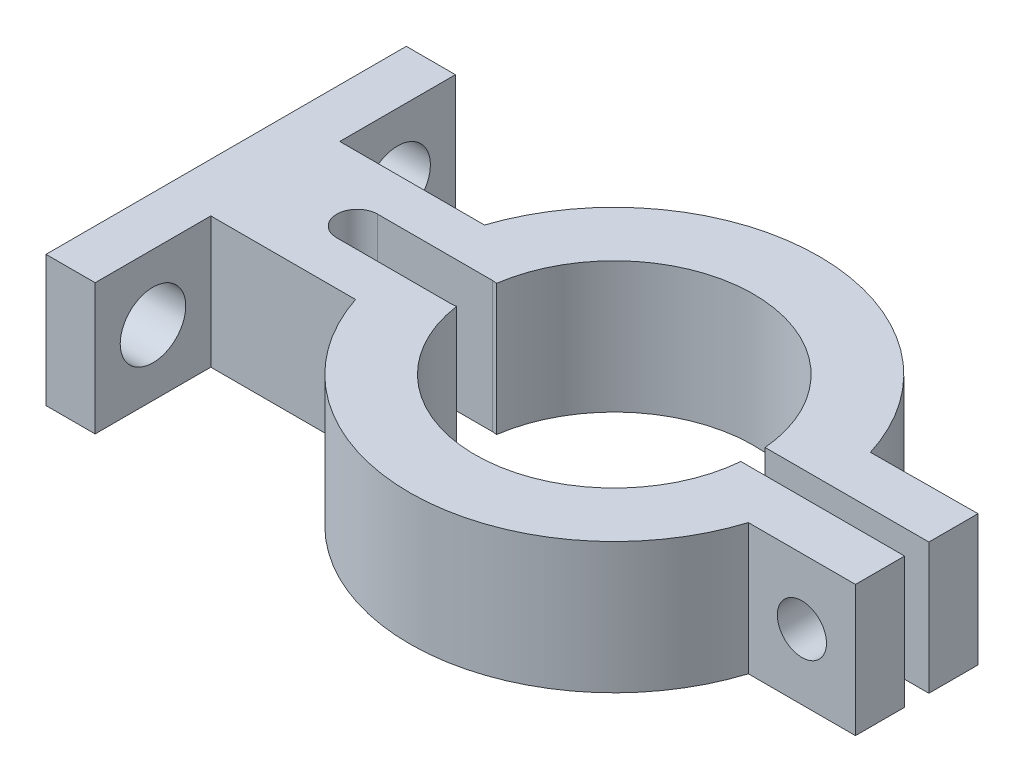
ISO-10303-21;
HEADER;
FILE_DESCRIPTION(('STEP AP214'),'2;1');
FILE_NAME('part.step','',(''),(''),'','','');
FILE_SCHEMA(('AUTOMOTIVE_DESIGN { 1 0 10303 214 1 1 1 1 }'));
ENDSEC;
DATA;
#1=APPLICATION_CONTEXT('core data for automotive mechanical design processes');
#2=APPLICATION_PROTOCOL_DEFINITION('international standard','automotive_design',2000,#1);
#3=PRODUCT_CONTEXT('',#1,'mechanical');
#4=PRODUCT('Part','Part','',(#3));
#5=PRODUCT_RELATED_PRODUCT_CATEGORY('part','',(#4));
#6=PRODUCT_DEFINITION_FORMATION('','',#4);
#7=PRODUCT_DEFINITION_CONTEXT('part definition',#1,'design');
#8=PRODUCT_DEFINITION('design','',#6,#7);
#9=PRODUCT_DEFINITION_SHAPE('','',#8);
#10=(LENGTH_UNIT() NAMED_UNIT(*) SI_UNIT(.MILLI.,.METRE.));
#11=(NAMED_UNIT(*) PLANE_ANGLE_UNIT() SI_UNIT($,.RADIAN.));
#12=(NAMED_UNIT(*) SI_UNIT($,.STERADIAN.) SOLID_ANGLE_UNIT());
#13=UNCERTAINTY_MEASURE_WITH_UNIT(LENGTH_MEASURE(1.E-05),#10,'distance_accuracy_value','');
#14=(GEOMETRIC_REPRESENTATION_CONTEXT(3) GLOBAL_UNCERTAINTY_ASSIGNED_CONTEXT((#13)) GLOBAL_UNIT_ASSIGNED_CONTEXT((#10,
#11,#12)) REPRESENTATION_CONTEXT('',''));
#15=CARTESIAN_POINT('',(0.,0.,0.));
#16=DIRECTION('',(0.,0.,1.));
#17=DIRECTION('',(1.,0.,0.));
#18=AXIS2_PLACEMENT_3D('',#15,#16,#17);
#19=CARTESIAN_POINT('',(16.2,8.,0.));
#20=DIRECTION('',(0.,-1.,0.));
#21=DIRECTION('',(0.,0.,-1.));
#22=AXIS2_PLACEMENT_3D('',#19,#20,#21);
#23=CYLINDRICAL_SURFACE('',#22,8.5);
#24=DIRECTION('',(0.,1.,0.));
#25=VECTOR('',#24,1.);
#26=CARTESIAN_POINT('',(7.7875,4.,-1.21648828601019));
#27=LINE('',#26,#25);
#28=CARTESIAN_POINT('',(7.7875,0.,-1.21648828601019));
#29=VERTEX_POINT('',#28);
#30=CARTESIAN_POINT('',(7.7875,8.,-1.21648828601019));
#31=VERTEX_POINT('',#30);
#32=EDGE_CURVE('E282',#29,#31,#27,.T.);
#33=ORIENTED_EDGE('',*,*,#32,.F.);
#34=CARTESIAN_POINT('',(16.2,0.,0.));
#35=DIRECTION('',(0.,1.,0.));
#36=DIRECTION('',(0.,0.,1.));
#37=AXIS2_PLACEMENT_3D('',#34,#35,#36);
#38=CIRCLE('',#37,8.5);
#39=CARTESIAN_POINT('',(24.6676549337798,0.,-0.740823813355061));
#40=VERTEX_POINT('',#39);
#41=EDGE_CURVE('E216',#40,#29,#38,.T.);
#42=ORIENTED_EDGE('',*,*,#41,.F.);
#43=DIRECTION('',(0.,-1.,0.));
#44=VECTOR('',#43,1.);
#45=CARTESIAN_POINT('',(24.6676549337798,8.,-0.740823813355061));
#46=LINE('',#45,#44);
#47=CARTESIAN_POINT('',(24.6676549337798,8.,-0.740823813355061));
#48=VERTEX_POINT('',#47);
#49=EDGE_CURVE('E260',#48,#40,#46,.T.);
#50=ORIENTED_EDGE('',*,*,#49,.F.);
#51=CARTESIAN_POINT('',(16.2,8.,0.));
#52=DIRECTION('',(0.,1.,0.));
#53=DIRECTION('',(0.,0.,1.));
#54=AXIS2_PLACEMENT_3D('',#51,#52,#53);
#55=CIRCLE('',#54,8.5);
#56=EDGE_CURVE('E315',#48,#31,#55,.T.);
#57=ORIENTED_EDGE('',*,*,#56,.T.);
#58=EDGE_LOOP('',(#33,#42,#50,#57));
#59=FACE_BOUND('',#58,.T.);
#60=ADVANCED_FACE('F39',(#59),#23,.F.);
#61=CARTESIAN_POINT('',(-7.5,8.,0.));
#62=DIRECTION('',(-1.,0.,0.));
#63=DIRECTION('',(0.,0.,1.));
#64=AXIS2_PLACEMENT_3D('',#61,#62,#63);
#65=PLANE('',#64);
#66=DIRECTION('',(0.,0.,-1.));
#67=VECTOR('',#66,1.);
#68=CARTESIAN_POINT('',(-7.5,0.,0.));
#69=LINE('',#68,#67);
#70=CARTESIAN_POINT('',(-7.5,0.,11.));
#71=VERTEX_POINT('',#70);
#72=CARTESIAN_POINT('',(-7.5,0.,-11.));
#73=VERTEX_POINT('',#72);
#74=EDGE_CURVE('E177',#71,#73,#69,.T.);
#75=ORIENTED_EDGE('',*,*,#74,.F.);
#76=DIRECTION('',(0.,-1.,0.));
#77=VECTOR('',#76,1.);
#78=CARTESIAN_POINT('',(-7.5,8.,11.));
#79=LINE('',#78,#77);
#80=CARTESIAN_POINT('',(-7.5,8.,11.));
#81=VERTEX_POINT('',#80);
#82=EDGE_CURVE('E170',#81,#71,#79,.T.);
#83=ORIENTED_EDGE('',*,*,#82,.F.);
#84=DIRECTION('',(0.,0.,-1.));
#85=VECTOR('',#84,1.);
#86=CARTESIAN_POINT('',(-7.5,8.,0.));
#87=LINE('',#86,#85);
#88=CARTESIAN_POINT('',(-7.5,8.,-11.));
#89=VERTEX_POINT('',#88);
#90=EDGE_CURVE('E175',#81,#89,#87,.T.);
#91=ORIENTED_EDGE('',*,*,#90,.T.);
#92=DIRECTION('',(0.,-1.,0.));
#93=VECTOR('',#92,1.);
#94=CARTESIAN_POINT('',(-7.5,8.,-11.));
#95=LINE('',#94,#93);
#96=EDGE_CURVE('E180',#89,#73,#95,.T.);
#97=ORIENTED_EDGE('',*,*,#96,.T.);
#98=EDGE_LOOP('',(#75,#83,#91,#97));
#99=FACE_BOUND('',#98,.T.);
#100=CARTESIAN_POINT('',(-7.5,4.,-7.46850393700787));
#101=DIRECTION('',(-1.,0.,0.));
#102=DIRECTION('',(0.,0.,1.));
#103=AXIS2_PLACEMENT_3D('',#100,#101,#102);
#104=CIRCLE('',#103,2.);
#105=CARTESIAN_POINT('',(-7.5,4.,-5.46850393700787));
#106=VERTEX_POINT('',#105);
#107=EDGE_CURVE('E293',#106,#106,#104,.T.);
#108=ORIENTED_EDGE('',*,*,#107,.F.);
#109=EDGE_LOOP('',(#108));
#110=FACE_BOUND('',#109,.T.);
#111=CARTESIAN_POINT('',(-7.5,4.,7.46850393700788));
#112=DIRECTION('',(-1.,0.,0.));
#113=DIRECTION('',(0.,0.,1.));
#114=AXIS2_PLACEMENT_3D('',#111,#112,#113);
#115=CIRCLE('',#114,2.);
#116=CARTESIAN_POINT('',(-7.5,4.,9.46850393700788));
#117=VERTEX_POINT('',#116);
#118=EDGE_CURVE('E296',#117,#117,#115,.F.);
#119=ORIENTED_EDGE('',*,*,#118,.T.);
#120=EDGE_LOOP('',(#119));
#121=FACE_BOUND('',#120,.T.);
#122=ADVANCED_FACE('F172',(#99,#110,#121),#65,.T.);
#123=CARTESIAN_POINT('',(0.,8.,3.93700787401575));
#124=DIRECTION('',(0.,0.,-1.));
#125=DIRECTION('',(-1.,0.,0.));
#126=AXIS2_PLACEMENT_3D('',#123,#124,#125);
#127=PLANE('',#126);
#128=DIRECTION('',(1.,0.,0.));
#129=VECTOR('',#128,1.);
#130=CARTESIAN_POINT('',(0.,0.,3.93700787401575));
#131=LINE('',#130,#129);
#132=CARTESIAN_POINT('',(-4.5,0.,3.93700787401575));
#133=VERTEX_POINT('',#132);
#134=CARTESIAN_POINT('',(4.33619078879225,0.,3.93700787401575));
#135=VERTEX_POINT('',#134);
#136=EDGE_CURVE('E200',#133,#135,#131,.T.);
#137=ORIENTED_EDGE('',*,*,#136,.T.);
#138=DIRECTION('',(0.,-1.,0.));
#139=VECTOR('',#138,1.);
#140=CARTESIAN_POINT('',(4.33619078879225,8.,3.93700787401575));
#141=LINE('',#140,#139);
#142=CARTESIAN_POINT('',(4.33619078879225,8.,3.93700787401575));
#143=VERTEX_POINT('',#142);
#144=EDGE_CURVE('E47',#143,#135,#141,.T.);
#145=ORIENTED_EDGE('',*,*,#144,.F.);
#146=DIRECTION('',(1.,0.,0.));
#147=VECTOR('',#146,1.);
#148=CARTESIAN_POINT('',(0.,8.,3.93700787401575));
#149=LINE('',#148,#147);
#150=CARTESIAN_POINT('',(-4.5,8.,3.93700787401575));
#151=VERTEX_POINT('',#150);
#152=EDGE_CURVE('E243',#151,#143,#149,.T.);
#153=ORIENTED_EDGE('',*,*,#152,.F.);
#154=DIRECTION('',(0.,-1.,0.));
#155=VECTOR('',#154,1.);
#156=CARTESIAN_POINT('',(-4.5,8.,3.93700787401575));
#157=LINE('',#156,#155);
#158=EDGE_CURVE('E199',#151,#133,#157,.T.);
#159=ORIENTED_EDGE('',*,*,#158,.T.);
#160=EDGE_LOOP('',(#137,#145,#153,#159));
#161=FACE_BOUND('',#160,.T.);
#162=ADVANCED_FACE('F41',(#161),#127,.F.);
#163=CARTESIAN_POINT('',(16.2,8.,0.));
#164=DIRECTION('',(0.,-1.,0.));
#165=DIRECTION('',(0.,0.,-1.));
#166=AXIS2_PLACEMENT_3D('',#163,#164,#165);
#167=CYLINDRICAL_SURFACE('',#166,12.5);
#168=CARTESIAN_POINT('',(16.2,0.,0.));
#169=DIRECTION('',(0.,1.,0.));
#170=DIRECTION('',(0.,0.,1.));
#171=AXIS2_PLACEMENT_3D('',#168,#169,#170);
#172=CIRCLE('',#171,12.5);
#173=CARTESIAN_POINT('',(28.1271219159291,0.,3.74082381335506));
#174=VERTEX_POINT('',#173);
#175=EDGE_CURVE('E203',#135,#174,#172,.T.);
#176=ORIENTED_EDGE('',*,*,#175,.T.);
#177=DIRECTION('',(0.,-1.,0.));
#178=VECTOR('',#177,1.);
#179=CARTESIAN_POINT('',(28.1271219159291,8.,3.74082381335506));
#180=LINE('',#179,#178);
#181=CARTESIAN_POINT('',(28.1271219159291,8.,3.74082381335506));
#182=VERTEX_POINT('',#181);
#183=EDGE_CURVE('E269',#182,#174,#180,.T.);
#184=ORIENTED_EDGE('',*,*,#183,.F.);
#185=CARTESIAN_POINT('',(16.2,8.,0.));
#186=DIRECTION('',(0.,1.,0.));
#187=DIRECTION('',(0.,0.,1.));
#188=AXIS2_PLACEMENT_3D('',#185,#186,#187);
#189=CIRCLE('',#188,12.5);
#190=EDGE_CURVE('E129',#143,#182,#189,.T.);
#191=ORIENTED_EDGE('',*,*,#190,.F.);
#192=ORIENTED_EDGE('',*,*,#144,.T.);
#193=EDGE_LOOP('',(#176,#184,#191,#192));
#194=FACE_BOUND('',#193,.T.);
#195=ADVANCED_FACE('F348',(#194),#167,.T.);
#196=CARTESIAN_POINT('',(0.,8.,3.74082381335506));
#197=DIRECTION('',(0.,0.,-1.));
#198=DIRECTION('',(-1.,0.,0.));
#199=AXIS2_PLACEMENT_3D('',#196,#197,#198);
#200=PLANE('',#199);
#201=CARTESIAN_POINT('',(31.3973884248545,4.,3.74082381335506));
#202=DIRECTION('',(0.,0.,1.));
#203=DIRECTION('',(1.,0.,0.));
#204=AXIS2_PLACEMENT_3D('',#201,#202,#203);
#205=CIRCLE('',#204,1.5);
#206=CARTESIAN_POINT('',(32.8973884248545,4.,3.74082381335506));
#207=VERTEX_POINT('',#206);
#208=EDGE_CURVE('E275',#207,#207,#205,.T.);
#209=ORIENTED_EDGE('',*,*,#208,.F.);
#210=EDGE_LOOP('',(#209));
#211=FACE_BOUND('',#210,.T.);
#212=DIRECTION('',(1.,0.,0.));
#213=VECTOR('',#212,1.);
#214=CARTESIAN_POINT('',(0.,0.,3.74082381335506));
#215=LINE('',#214,#213);
#216=CARTESIAN_POINT('',(34.6676549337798,0.,3.74082381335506));
#217=VERTEX_POINT('',#216);
#218=EDGE_CURVE('E206',#174,#217,#215,.T.);
#219=ORIENTED_EDGE('',*,*,#218,.T.);
#220=DIRECTION('',(0.,-1.,0.));
#221=VECTOR('',#220,1.);
#222=CARTESIAN_POINT('',(34.6676549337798,8.,3.74082381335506));
#223=LINE('',#222,#221);
#224=CARTESIAN_POINT('',(34.6676549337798,8.,3.74082381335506));
#225=VERTEX_POINT('',#224);
#226=EDGE_CURVE('E267',#225,#217,#223,.T.);
#227=ORIENTED_EDGE('',*,*,#226,.F.);
#228=DIRECTION('',(1.,0.,0.));
#229=VECTOR('',#228,1.);
#230=CARTESIAN_POINT('',(0.,8.,3.74082381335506));
#231=LINE('',#230,#229);
#232=EDGE_CURVE('E306',#182,#225,#231,.T.);
#233=ORIENTED_EDGE('',*,*,#232,.F.);
#234=ORIENTED_EDGE('',*,*,#183,.T.);
#235=EDGE_LOOP('',(#219,#227,#233,#234));
#236=FACE_BOUND('',#235,.T.);
#237=ADVANCED_FACE('F351',(#211,#236),#200,.F.);
#238=CARTESIAN_POINT('',(34.6676549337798,8.,0.));
#239=DIRECTION('',(1.,0.,0.));
#240=DIRECTION('',(0.,0.,-1.));
#241=AXIS2_PLACEMENT_3D('',#238,#239,#240);
#242=PLANE('',#241);
#243=DIRECTION('',(0.,0.,1.));
#244=VECTOR('',#243,1.);
#245=CARTESIAN_POINT('',(34.6676549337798,0.,0.));
#246=LINE('',#245,#244);
#247=CARTESIAN_POINT('',(34.6676549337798,0.,0.740823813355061));
#248=VERTEX_POINT('',#247);
#249=EDGE_CURVE('E209',#248,#217,#246,.T.);
#250=ORIENTED_EDGE('',*,*,#249,.F.);
#251=DIRECTION('',(0.,-1.,0.));
#252=VECTOR('',#251,1.);
#253=CARTESIAN_POINT('',(34.6676549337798,8.,0.740823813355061));
#254=LINE('',#253,#252);
#255=CARTESIAN_POINT('',(34.6676549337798,8.,0.740823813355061));
#256=VERTEX_POINT('',#255);
#257=EDGE_CURVE('E265',#256,#248,#254,.T.);
#258=ORIENTED_EDGE('',*,*,#257,.F.);
#259=DIRECTION('',(0.,0.,1.));
#260=VECTOR('',#259,1.);
#261=CARTESIAN_POINT('',(34.6676549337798,8.,0.));
#262=LINE('',#261,#260);
#263=EDGE_CURVE('E308',#256,#225,#262,.T.);
#264=ORIENTED_EDGE('',*,*,#263,.T.);
#265=ORIENTED_EDGE('',*,*,#226,.T.);
#266=EDGE_LOOP('',(#250,#258,#264,#265));
#267=FACE_BOUND('',#266,.T.);
#268=ADVANCED_FACE('F354',(#267),#242,.T.);
#269=CARTESIAN_POINT('',(0.,8.,0.740823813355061));
#270=DIRECTION('',(0.,0.,-1.));
#271=DIRECTION('',(-1.,0.,0.));
#272=AXIS2_PLACEMENT_3D('',#269,#270,#271);
#273=PLANE('',#272);
#274=CARTESIAN_POINT('',(31.3973884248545,4.,0.740823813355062));
#275=DIRECTION('',(0.,0.,-1.));
#276=DIRECTION('',(-1.,0.,0.));
#277=AXIS2_PLACEMENT_3D('',#274,#275,#276);
#278=CIRCLE('',#277,1.5);
#279=CARTESIAN_POINT('',(29.8973884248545,4.,0.740823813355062));
#280=VERTEX_POINT('',#279);
#281=EDGE_CURVE('E279',#280,#280,#278,.T.);
#282=ORIENTED_EDGE('',*,*,#281,.F.);
#283=EDGE_LOOP('',(#282));
#284=FACE_BOUND('',#283,.T.);
#285=DIRECTION('',(1.,0.,0.));
#286=VECTOR('',#285,1.);
#287=CARTESIAN_POINT('',(0.,0.,0.740823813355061));
#288=LINE('',#287,#286);
#289=CARTESIAN_POINT('',(24.6676549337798,0.,0.740823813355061));
#290=VERTEX_POINT('',#289);
#291=EDGE_CURVE('E212',#290,#248,#288,.T.);
#292=ORIENTED_EDGE('',*,*,#291,.F.);
#293=DIRECTION('',(0.,-1.,0.));
#294=VECTOR('',#293,1.);
#295=CARTESIAN_POINT('',(24.6676549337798,8.,0.740823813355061));
#296=LINE('',#295,#294);
#297=CARTESIAN_POINT('',(24.6676549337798,8.,0.740823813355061));
#298=VERTEX_POINT('',#297);
#299=EDGE_CURVE('E262',#298,#290,#296,.T.);
#300=ORIENTED_EDGE('',*,*,#299,.F.);
#301=DIRECTION('',(1.,0.,0.));
#302=VECTOR('',#301,1.);
#303=CARTESIAN_POINT('',(0.,8.,0.740823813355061));
#304=LINE('',#303,#302);
#305=EDGE_CURVE('E311',#298,#256,#304,.T.);
#306=ORIENTED_EDGE('',*,*,#305,.T.);
#307=ORIENTED_EDGE('',*,*,#257,.T.);
#308=EDGE_LOOP('',(#292,#300,#306,#307));
#309=FACE_BOUND('',#308,.T.);
#310=ADVANCED_FACE('F360',(#284,#309),#273,.T.);
#311=DIRECTION('',(0.,1.,0.));
#312=VECTOR('',#311,1.);
#313=CARTESIAN_POINT('',(7.7875,4.,1.21648828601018));
#314=LINE('',#313,#312);
#315=CARTESIAN_POINT('',(7.7875,8.,1.21648828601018));
#316=VERTEX_POINT('',#315);
#317=CARTESIAN_POINT('',(7.7875,0.,1.21648828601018));
#318=VERTEX_POINT('',#317);
#319=EDGE_CURVE('E287',#316,#318,#314,.F.);
#320=ORIENTED_EDGE('',*,*,#319,.F.);
#321=EDGE_CURVE('E314',#316,#298,#55,.T.);
#322=ORIENTED_EDGE('',*,*,#321,.T.);
#323=ORIENTED_EDGE('',*,*,#299,.T.);
#324=EDGE_CURVE('E215',#318,#290,#38,.T.);
#325=ORIENTED_EDGE('',*,*,#324,.F.);
#326=EDGE_LOOP('',(#320,#322,#323,#325));
#327=FACE_BOUND('',#326,.T.);
#328=ADVANCED_FACE('F364',(#327),#23,.F.);
#329=CARTESIAN_POINT('',(0.,8.,-0.740823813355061));
#330=DIRECTION('',(0.,0.,-1.));
#331=DIRECTION('',(-1.,0.,0.));
#332=AXIS2_PLACEMENT_3D('',#329,#330,#331);
#333=PLANE('',#332);
#334=CARTESIAN_POINT('',(31.3973884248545,4.,-0.740823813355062));
#335=DIRECTION('',(0.,0.,-1.));
#336=DIRECTION('',(-1.,0.,0.));
#337=AXIS2_PLACEMENT_3D('',#334,#335,#336);
#338=CIRCLE('',#337,1.5);
#339=CARTESIAN_POINT('',(29.8973884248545,4.,-0.740823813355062));
#340=VERTEX_POINT('',#339);
#341=EDGE_CURVE('E274',#340,#340,#338,.T.);
#342=ORIENTED_EDGE('',*,*,#341,.T.);
#343=EDGE_LOOP('',(#342));
#344=FACE_BOUND('',#343,.T.);
#345=DIRECTION('',(1.,0.,0.));
#346=VECTOR('',#345,1.);
#347=CARTESIAN_POINT('',(0.,0.,-0.740823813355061));
#348=LINE('',#347,#346);
#349=CARTESIAN_POINT('',(34.6676549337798,0.,-0.740823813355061));
#350=VERTEX_POINT('',#349);
#351=EDGE_CURVE('E219',#40,#350,#348,.T.);
#352=ORIENTED_EDGE('',*,*,#351,.T.);
#353=DIRECTION('',(0.,-1.,0.));
#354=VECTOR('',#353,1.);
#355=CARTESIAN_POINT('',(34.6676549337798,8.,-0.740823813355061));
#356=LINE('',#355,#354);
#357=CARTESIAN_POINT('',(34.6676549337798,8.,-0.740823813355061));
#358=VERTEX_POINT('',#357);
#359=EDGE_CURVE('E257',#358,#350,#356,.T.);
#360=ORIENTED_EDGE('',*,*,#359,.F.);
#361=DIRECTION('',(1.,0.,0.));
#362=VECTOR('',#361,1.);
#363=CARTESIAN_POINT('',(0.,8.,-0.740823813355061));
#364=LINE('',#363,#362);
#365=EDGE_CURVE('E318',#48,#358,#364,.T.);
#366=ORIENTED_EDGE('',*,*,#365,.F.);
#367=ORIENTED_EDGE('',*,*,#49,.T.);
#368=EDGE_LOOP('',(#352,#360,#366,#367));
#369=FACE_BOUND('',#368,.T.);
#370=ADVANCED_FACE('F399',(#344,#369),#333,.F.);
#371=CARTESIAN_POINT('',(34.6676549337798,8.,0.));
#372=DIRECTION('',(-1.,0.,0.));
#373=DIRECTION('',(0.,0.,1.));
#374=AXIS2_PLACEMENT_3D('',#371,#372,#373);
#375=PLANE('',#374);
#376=DIRECTION('',(0.,0.,-1.));
#377=VECTOR('',#376,1.);
#378=CARTESIAN_POINT('',(34.6676549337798,0.,0.));
#379=LINE('',#378,#377);
#380=CARTESIAN_POINT('',(34.6676549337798,0.,-3.74082381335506));
#381=VERTEX_POINT('',#380);
#382=EDGE_CURVE('E221',#350,#381,#379,.T.);
#383=ORIENTED_EDGE('',*,*,#382,.T.);
#384=DIRECTION('',(0.,-1.,0.));
#385=VECTOR('',#384,1.);
#386=CARTESIAN_POINT('',(34.6676549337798,8.,-3.74082381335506));
#387=LINE('',#386,#385);
#388=CARTESIAN_POINT('',(34.6676549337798,8.,-3.74082381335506));
#389=VERTEX_POINT('',#388);
#390=EDGE_CURVE('E255',#389,#381,#387,.T.);
#391=ORIENTED_EDGE('',*,*,#390,.F.);
#392=DIRECTION('',(0.,0.,-1.));
#393=VECTOR('',#392,1.);
#394=CARTESIAN_POINT('',(34.6676549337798,8.,0.));
#395=LINE('',#394,#393);
#396=EDGE_CURVE('E320',#358,#389,#395,.T.);
#397=ORIENTED_EDGE('',*,*,#396,.F.);
#398=ORIENTED_EDGE('',*,*,#359,.T.);
#399=EDGE_LOOP('',(#383,#391,#397,#398));
#400=FACE_BOUND('',#399,.T.);
#401=ADVANCED_FACE('F403',(#400),#375,.F.);
#402=CARTESIAN_POINT('',(-0.0225091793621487,8.,-3.51892444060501));
#403=DIRECTION('',(-0.00639647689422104,0.,-0.999979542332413));
#404=DIRECTION('',(-0.999979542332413,0.,0.00639647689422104));
#405=AXIS2_PLACEMENT_3D('',#402,#403,#404);
#406=PLANE('',#405);
#407=CARTESIAN_POINT('',(31.3973884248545,4.,-3.71990520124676));
#408=DIRECTION('',(-0.00639647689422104,0.,-0.999979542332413));
#409=DIRECTION('',(-0.999979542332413,0.,0.00639647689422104));
#410=AXIS2_PLACEMENT_3D('',#407,#408,#409);
#411=ELLIPSE('',#410,1.50003068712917,1.5);
#412=CARTESIAN_POINT('',(29.8973884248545,4.,-3.71031028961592));
#413=VERTEX_POINT('',#412);
#414=EDGE_CURVE('E272',#413,#413,#411,.T.);
#415=ORIENTED_EDGE('',*,*,#414,.F.);
#416=EDGE_LOOP('',(#415));
#417=FACE_BOUND('',#416,.T.);
#418=DIRECTION('',(0.999979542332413,0.,-0.00639647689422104));
#419=VECTOR('',#418,1.);
#420=CARTESIAN_POINT('',(-0.0225091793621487,0.,-3.51892444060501));
#421=LINE('',#420,#419);
#422=CARTESIAN_POINT('',(28.1401374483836,0.,-3.69906984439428));
#423=VERTEX_POINT('',#422);
#424=EDGE_CURVE('E224',#423,#381,#421,.T.);
#425=ORIENTED_EDGE('',*,*,#424,.F.);
#426=DIRECTION('',(0.,-1.,0.));
#427=VECTOR('',#426,1.);
#428=CARTESIAN_POINT('',(28.1401374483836,8.,-3.69906984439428));
#429=LINE('',#428,#427);
#430=CARTESIAN_POINT('',(28.1401374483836,8.,-3.69906984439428));
#431=VERTEX_POINT('',#430);
#432=EDGE_CURVE('E253',#431,#423,#429,.T.);
#433=ORIENTED_EDGE('',*,*,#432,.F.);
#434=DIRECTION('',(0.999979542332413,0.,-0.00639647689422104));
#435=VECTOR('',#434,1.);
#436=CARTESIAN_POINT('',(-0.0225091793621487,8.,-3.51892444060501));
#437=LINE('',#436,#435);
#438=EDGE_CURVE('E322',#431,#389,#437,.T.);
#439=ORIENTED_EDGE('',*,*,#438,.T.);
#440=ORIENTED_EDGE('',*,*,#390,.T.);
#441=EDGE_LOOP('',(#425,#433,#439,#440));
#442=FACE_BOUND('',#441,.T.);
#443=ADVANCED_FACE('F577',(#417,#442),#406,.T.);
#444=CARTESIAN_POINT('',(16.2,8.,0.));
#445=DIRECTION('',(0.,-1.,0.));
#446=DIRECTION('',(0.,0.,-1.));
#447=AXIS2_PLACEMENT_3D('',#444,#445,#446);
#448=CYLINDRICAL_SURFACE('',#447,12.5);
#449=CARTESIAN_POINT('',(16.2,0.,0.));
#450=DIRECTION('',(0.,1.,0.));
#451=DIRECTION('',(0.,0.,1.));
#452=AXIS2_PLACEMENT_3D('',#449,#450,#451);
#453=CIRCLE('',#452,12.5);
#454=CARTESIAN_POINT('',(4.33619078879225,0.,-3.93700787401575));
#455=VERTEX_POINT('',#454);
#456=EDGE_CURVE('E227',#423,#455,#453,.T.);
#457=ORIENTED_EDGE('',*,*,#456,.T.);
#458=DIRECTION('',(0.,-1.,0.));
#459=VECTOR('',#458,1.);
#460=CARTESIAN_POINT('',(4.33619078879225,8.,-3.93700787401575));
#461=LINE('',#460,#459);
#462=CARTESIAN_POINT('',(4.33619078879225,8.,-3.93700787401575));
#463=VERTEX_POINT('',#462);
#464=EDGE_CURVE('E251',#463,#455,#461,.T.);
#465=ORIENTED_EDGE('',*,*,#464,.F.);
#466=CARTESIAN_POINT('',(16.2,8.,0.));
#467=DIRECTION('',(0.,1.,0.));
#468=DIRECTION('',(0.,0.,1.));
#469=AXIS2_PLACEMENT_3D('',#466,#467,#468);
#470=CIRCLE('',#469,12.5);
#471=EDGE_CURVE('E325',#431,#463,#470,.T.);
#472=ORIENTED_EDGE('',*,*,#471,.F.);
#473=ORIENTED_EDGE('',*,*,#432,.T.);
#474=EDGE_LOOP('',(#457,#465,#472,#473));
#475=FACE_BOUND('',#474,.T.);
#476=ADVANCED_FACE('F582',(#475),#448,.T.);
#477=CARTESIAN_POINT('',(0.,8.,-3.93700787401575));
#478=DIRECTION('',(0.,0.,-1.));
#479=DIRECTION('',(-1.,0.,0.));
#480=AXIS2_PLACEMENT_3D('',#477,#478,#479);
#481=PLANE('',#480);
#482=DIRECTION('',(1.,0.,0.));
#483=VECTOR('',#482,1.);
#484=CARTESIAN_POINT('',(0.,0.,-3.93700787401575));
#485=LINE('',#484,#483);
#486=CARTESIAN_POINT('',(-4.5,0.,-3.93700787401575));
#487=VERTEX_POINT('',#486);
#488=EDGE_CURVE('E230',#487,#455,#485,.T.);
#489=ORIENTED_EDGE('',*,*,#488,.F.);
#490=DIRECTION('',(0.,-1.,0.));
#491=VECTOR('',#490,1.);
#492=CARTESIAN_POINT('',(-4.5,8.,-3.93700787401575));
#493=LINE('',#492,#491);
#494=CARTESIAN_POINT('',(-4.5,8.,-3.93700787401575));
#495=VERTEX_POINT('',#494);
#496=EDGE_CURVE('E249',#495,#487,#493,.T.);
#497=ORIENTED_EDGE('',*,*,#496,.F.);
#498=DIRECTION('',(1.,0.,0.));
#499=VECTOR('',#498,1.);
#500=CARTESIAN_POINT('',(0.,8.,-3.93700787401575));
#501=LINE('',#500,#499);
#502=EDGE_CURVE('E327',#495,#463,#501,.T.);
#503=ORIENTED_EDGE('',*,*,#502,.T.);
#504=ORIENTED_EDGE('',*,*,#464,.T.);
#505=EDGE_LOOP('',(#489,#497,#503,#504));
#506=FACE_BOUND('',#505,.T.);
#507=ADVANCED_FACE('F512',(#506),#481,.T.);
#508=CARTESIAN_POINT('',(-4.5,8.,0.));
#509=DIRECTION('',(1.,0.,0.));
#510=DIRECTION('',(0.,0.,-1.));
#511=AXIS2_PLACEMENT_3D('',#508,#509,#510);
#512=PLANE('',#511);
#513=CARTESIAN_POINT('',(-4.5,4.,-7.46850393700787));
#514=DIRECTION('',(-1.,0.,0.));
#515=DIRECTION('',(0.,0.,1.));
#516=AXIS2_PLACEMENT_3D('',#513,#514,#515);
#517=CIRCLE('',#516,2.);
#518=CARTESIAN_POINT('',(-4.5,4.,-5.46850393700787));
#519=VERTEX_POINT('',#518);
#520=EDGE_CURVE('E299',#519,#519,#517,.T.);
#521=ORIENTED_EDGE('',*,*,#520,.T.);
#522=EDGE_LOOP('',(#521));
#523=FACE_BOUND('',#522,.T.);
#524=DIRECTION('',(0.,0.,1.));
#525=VECTOR('',#524,1.);
#526=CARTESIAN_POINT('',(-4.5,0.,0.));
#527=LINE('',#526,#525);
#528=CARTESIAN_POINT('',(-4.5,0.,-11.));
#529=VERTEX_POINT('',#528);
#530=EDGE_CURVE('E233',#529,#487,#527,.T.);
#531=ORIENTED_EDGE('',*,*,#530,.F.);
#532=DIRECTION('',(0.,-1.,0.));
#533=VECTOR('',#532,1.);
#534=CARTESIAN_POINT('',(-4.5,8.,-11.));
#535=LINE('',#534,#533);
#536=CARTESIAN_POINT('',(-4.5,8.,-11.));
#537=VERTEX_POINT('',#536);
#538=EDGE_CURVE('E247',#537,#529,#535,.T.);
#539=ORIENTED_EDGE('',*,*,#538,.F.);
#540=DIRECTION('',(0.,0.,1.));
#541=VECTOR('',#540,1.);
#542=CARTESIAN_POINT('',(-4.5,8.,0.));
#543=LINE('',#542,#541);
#544=EDGE_CURVE('E194',#537,#495,#543,.T.);
#545=ORIENTED_EDGE('',*,*,#544,.T.);
#546=ORIENTED_EDGE('',*,*,#496,.T.);
#547=EDGE_LOOP('',(#531,#539,#545,#546));
#548=FACE_BOUND('',#547,.T.);
#549=ADVANCED_FACE('F332',(#523,#548),#512,.T.);
#550=CARTESIAN_POINT('',(0.,8.,-11.));
#551=DIRECTION('',(0.,0.,-1.));
#552=DIRECTION('',(-1.,0.,0.));
#553=AXIS2_PLACEMENT_3D('',#550,#551,#552);
#554=PLANE('',#553);
#555=DIRECTION('',(1.,0.,0.));
#556=VECTOR('',#555,1.);
#557=CARTESIAN_POINT('',(0.,0.,-11.));
#558=LINE('',#557,#556);
#559=EDGE_CURVE('E236',#73,#529,#558,.T.);
#560=ORIENTED_EDGE('',*,*,#559,.F.);
#561=ORIENTED_EDGE('',*,*,#96,.F.);
#562=DIRECTION('',(1.,0.,0.));
#563=VECTOR('',#562,1.);
#564=CARTESIAN_POINT('',(0.,8.,-11.));
#565=LINE('',#564,#563);
#566=EDGE_CURVE('E192',#89,#537,#565,.T.);
#567=ORIENTED_EDGE('',*,*,#566,.T.);
#568=ORIENTED_EDGE('',*,*,#538,.T.);
#569=EDGE_LOOP('',(#560,#561,#567,#568));
#570=FACE_BOUND('',#569,.T.);
#571=ADVANCED_FACE('F337',(#570),#554,.T.);
#572=CARTESIAN_POINT('',(0.,8.,11.));
#573=DIRECTION('',(0.,0.,-1.));
#574=DIRECTION('',(-1.,0.,0.));
#575=AXIS2_PLACEMENT_3D('',#572,#573,#574);
#576=PLANE('',#575);
#577=DIRECTION('',(1.,0.,0.));
#578=VECTOR('',#577,1.);
#579=CARTESIAN_POINT('',(0.,0.,11.));
#580=LINE('',#579,#578);
#581=CARTESIAN_POINT('',(-4.5,0.,11.));
#582=VERTEX_POINT('',#581);
#583=EDGE_CURVE('E240',#71,#582,#580,.T.);
#584=ORIENTED_EDGE('',*,*,#583,.T.);
#585=DIRECTION('',(0.,-1.,0.));
#586=VECTOR('',#585,1.);
#587=CARTESIAN_POINT('',(-4.5,8.,11.));
#588=LINE('',#587,#586);
#589=CARTESIAN_POINT('',(-4.5,8.,11.));
#590=VERTEX_POINT('',#589);
#591=EDGE_CURVE('E181',#590,#582,#588,.T.);
#592=ORIENTED_EDGE('',*,*,#591,.F.);
#593=DIRECTION('',(1.,0.,0.));
#594=VECTOR('',#593,1.);
#595=CARTESIAN_POINT('',(0.,8.,11.));
#596=LINE('',#595,#594);
#597=EDGE_CURVE('E184',#81,#590,#596,.T.);
#598=ORIENTED_EDGE('',*,*,#597,.F.);
#599=ORIENTED_EDGE('',*,*,#82,.T.);
#600=EDGE_LOOP('',(#584,#592,#598,#599));
#601=FACE_BOUND('',#600,.T.);
#602=ADVANCED_FACE('F185',(#601),#576,.F.);
#603=CARTESIAN_POINT('',(-4.5,8.,0.));
#604=DIRECTION('',(-1.,0.,0.));
#605=DIRECTION('',(0.,0.,1.));
#606=AXIS2_PLACEMENT_3D('',#603,#604,#605);
#607=PLANE('',#606);
#608=CARTESIAN_POINT('',(-4.5,4.,7.46850393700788));
#609=DIRECTION('',(-1.,0.,0.));
#610=DIRECTION('',(0.,0.,1.));
#611=AXIS2_PLACEMENT_3D('',#608,#609,#610);
#612=CIRCLE('',#611,2.);
#613=CARTESIAN_POINT('',(-4.5,4.,9.46850393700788));
#614=VERTEX_POINT('',#613);
#615=EDGE_CURVE('E204',#614,#614,#612,.F.);
#616=ORIENTED_EDGE('',*,*,#615,.F.);
#617=EDGE_LOOP('',(#616));
#618=FACE_BOUND('',#617,.T.);
#619=DIRECTION('',(0.,0.,-1.));
#620=VECTOR('',#619,1.);
#621=CARTESIAN_POINT('',(-4.5,0.,0.));
#622=LINE('',#621,#620);
#623=EDGE_CURVE('E120',#582,#133,#622,.T.);
#624=ORIENTED_EDGE('',*,*,#623,.T.);
#625=ORIENTED_EDGE('',*,*,#158,.F.);
#626=DIRECTION('',(0.,0.,-1.));
#627=VECTOR('',#626,1.);
#628=CARTESIAN_POINT('',(-4.5,8.,0.));
#629=LINE('',#628,#627);
#630=EDGE_CURVE('E63',#590,#151,#629,.T.);
#631=ORIENTED_EDGE('',*,*,#630,.F.);
#632=ORIENTED_EDGE('',*,*,#591,.T.);
#633=EDGE_LOOP('',(#624,#625,#631,#632));
#634=FACE_BOUND('',#633,.T.);
#635=ADVANCED_FACE('F341',(#618,#634),#607,.F.);
#636=CARTESIAN_POINT('',(0.,8.,0.));
#637=DIRECTION('',(0.,1.,0.));
#638=DIRECTION('',(0.,0.,1.));
#639=AXIS2_PLACEMENT_3D('',#636,#637,#638);
#640=PLANE('',#639);
#641=CARTESIAN_POINT('',(7.50000000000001,8.,0.));
#642=DIRECTION('',(0.,1.,0.));
#643=DIRECTION('',(0.,0.,1.));
#644=AXIS2_PLACEMENT_3D('',#641,#642,#643);
#645=CIRCLE('',#644,1.25);
#646=CARTESIAN_POINT('',(7.50000000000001,8.,-1.25));
#647=VERTEX_POINT('',#646);
#648=EDGE_CURVE('E407',#31,#647,#645,.T.);
#649=ORIENTED_EDGE('',*,*,#648,.F.);
#650=ORIENTED_EDGE('',*,*,#56,.F.);
#651=ORIENTED_EDGE('',*,*,#365,.T.);
#652=ORIENTED_EDGE('',*,*,#396,.T.);
#653=ORIENTED_EDGE('',*,*,#438,.F.);
#654=ORIENTED_EDGE('',*,*,#471,.T.);
#655=ORIENTED_EDGE('',*,*,#502,.F.);
#656=ORIENTED_EDGE('',*,*,#544,.F.);
#657=ORIENTED_EDGE('',*,*,#566,.F.);
#658=ORIENTED_EDGE('',*,*,#90,.F.);
#659=ORIENTED_EDGE('',*,*,#597,.T.);
#660=ORIENTED_EDGE('',*,*,#630,.T.);
#661=ORIENTED_EDGE('',*,*,#152,.T.);
#662=ORIENTED_EDGE('',*,*,#190,.T.);
#663=ORIENTED_EDGE('',*,*,#232,.T.);
#664=ORIENTED_EDGE('',*,*,#263,.F.);
#665=ORIENTED_EDGE('',*,*,#305,.F.);
#666=ORIENTED_EDGE('',*,*,#321,.F.);
#667=CARTESIAN_POINT('',(7.50000000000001,8.,1.25));
#668=VERTEX_POINT('',#667);
#669=EDGE_CURVE('E371',#668,#316,#645,.T.);
#670=ORIENTED_EDGE('',*,*,#669,.F.);
#671=DIRECTION('',(1.,0.,0.));
#672=VECTOR('',#671,1.);
#673=CARTESIAN_POINT('',(0.500000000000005,8.,1.25));
#674=LINE('',#673,#672);
#675=CARTESIAN_POINT('',(0.500000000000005,8.,1.25));
#676=VERTEX_POINT('',#675);
#677=EDGE_CURVE('E412',#676,#668,#674,.T.);
#678=ORIENTED_EDGE('',*,*,#677,.F.);
#679=CARTESIAN_POINT('',(0.500000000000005,8.,0.));
#680=DIRECTION('',(0.,1.,0.));
#681=DIRECTION('',(0.,0.,1.));
#682=AXIS2_PLACEMENT_3D('',#679,#680,#681);
#683=CIRCLE('',#682,1.25);
#684=CARTESIAN_POINT('',(0.500000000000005,8.,-1.25));
#685=VERTEX_POINT('',#684);
#686=EDGE_CURVE('E415',#685,#676,#683,.T.);
#687=ORIENTED_EDGE('',*,*,#686,.F.);
#688=DIRECTION('',(-1.,0.,0.));
#689=VECTOR('',#688,1.);
#690=CARTESIAN_POINT('',(0.500000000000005,8.,-1.25));
#691=LINE('',#690,#689);
#692=EDGE_CURVE('E411',#647,#685,#691,.T.);
#693=ORIENTED_EDGE('',*,*,#692,.F.);
#694=EDGE_LOOP('',(#649,#650,#651,#652,#653,#654,#655,#656,#657,#658,#659,#660,#661,#662,#663,
#664,#665,#666,#670,#678,#687,#693));
#695=FACE_BOUND('',#694,.T.);
#696=ADVANCED_FACE('F189',(#695),#640,.T.);
#697=CARTESIAN_POINT('',(0.,0.,0.));
#698=DIRECTION('',(0.,1.,0.));
#699=DIRECTION('',(0.,0.,1.));
#700=AXIS2_PLACEMENT_3D('',#697,#698,#699);
#701=PLANE('',#700);
#702=ORIENTED_EDGE('',*,*,#41,.T.);
#703=CARTESIAN_POINT('',(7.50000000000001,0.,0.));
#704=DIRECTION('',(0.,1.,0.));
#705=DIRECTION('',(0.,0.,1.));
#706=AXIS2_PLACEMENT_3D('',#703,#704,#705);
#707=CIRCLE('',#706,1.25);
#708=CARTESIAN_POINT('',(7.50000000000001,0.,-1.25));
#709=VERTEX_POINT('',#708);
#710=EDGE_CURVE('E11',#29,#709,#707,.T.);
#711=ORIENTED_EDGE('',*,*,#710,.T.);
#712=DIRECTION('',(-1.,0.,0.));
#713=VECTOR('',#712,1.);
#714=CARTESIAN_POINT('',(0.500000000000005,0.,-1.25));
#715=LINE('',#714,#713);
#716=CARTESIAN_POINT('',(0.500000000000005,0.,-1.25));
#717=VERTEX_POINT('',#716);
#718=EDGE_CURVE('E429',#709,#717,#715,.T.);
#719=ORIENTED_EDGE('',*,*,#718,.T.);
#720=CARTESIAN_POINT('',(0.500000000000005,0.,0.));
#721=DIRECTION('',(0.,1.,0.));
#722=DIRECTION('',(0.,0.,1.));
#723=AXIS2_PLACEMENT_3D('',#720,#721,#722);
#724=CIRCLE('',#723,1.25);
#725=CARTESIAN_POINT('',(0.500000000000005,0.,1.25));
#726=VERTEX_POINT('',#725);
#727=EDGE_CURVE('E420',#717,#726,#724,.T.);
#728=ORIENTED_EDGE('',*,*,#727,.T.);
#729=DIRECTION('',(1.,0.,0.));
#730=VECTOR('',#729,1.);
#731=CARTESIAN_POINT('',(0.500000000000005,0.,1.25));
#732=LINE('',#731,#730);
#733=CARTESIAN_POINT('',(7.50000000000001,0.,1.25));
#734=VERTEX_POINT('',#733);
#735=EDGE_CURVE('E437',#726,#734,#732,.T.);
#736=ORIENTED_EDGE('',*,*,#735,.T.);
#737=CARTESIAN_POINT('',(7.50000000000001,0.,0.));
#738=DIRECTION('',(0.,1.,0.));
#739=DIRECTION('',(0.,0.,1.));
#740=AXIS2_PLACEMENT_3D('',#737,#738,#739);
#741=CIRCLE('',#740,1.25);
#742=EDGE_CURVE('E54',#734,#318,#741,.T.);
#743=ORIENTED_EDGE('',*,*,#742,.T.);
#744=ORIENTED_EDGE('',*,*,#324,.T.);
#745=ORIENTED_EDGE('',*,*,#291,.T.);
#746=ORIENTED_EDGE('',*,*,#249,.T.);
#747=ORIENTED_EDGE('',*,*,#218,.F.);
#748=ORIENTED_EDGE('',*,*,#175,.F.);
#749=ORIENTED_EDGE('',*,*,#136,.F.);
#750=ORIENTED_EDGE('',*,*,#623,.F.);
#751=ORIENTED_EDGE('',*,*,#583,.F.);
#752=ORIENTED_EDGE('',*,*,#74,.T.);
#753=ORIENTED_EDGE('',*,*,#559,.T.);
#754=ORIENTED_EDGE('',*,*,#530,.T.);
#755=ORIENTED_EDGE('',*,*,#488,.T.);
#756=ORIENTED_EDGE('',*,*,#456,.F.);
#757=ORIENTED_EDGE('',*,*,#424,.T.);
#758=ORIENTED_EDGE('',*,*,#382,.F.);
#759=ORIENTED_EDGE('',*,*,#351,.F.);
#760=EDGE_LOOP('',(#702,#711,#719,#728,#736,#743,#744,#745,#746,#747,#748,#749,#750,#751,#752,
#753,#754,#755,#756,#757,#758,#759));
#761=FACE_BOUND('',#760,.T.);
#762=ADVANCED_FACE('F339',(#761),#701,.F.);
#763=CARTESIAN_POINT('',(-4.5,4.,7.46850393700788));
#764=DIRECTION('',(-1.,0.,0.));
#765=DIRECTION('',(0.,0.,1.));
#766=AXIS2_PLACEMENT_3D('',#763,#764,#765);
#767=CYLINDRICAL_SURFACE('',#766,2.);
#768=ORIENTED_EDGE('',*,*,#615,.T.);
#769=EDGE_LOOP('',(#768));
#770=FACE_BOUND('',#769,.T.);
#771=ORIENTED_EDGE('',*,*,#118,.F.);
#772=EDGE_LOOP('',(#771));
#773=FACE_BOUND('',#772,.T.);
#774=ADVANCED_FACE('F533',(#770,#773),#767,.F.);
#775=CARTESIAN_POINT('',(-4.5,4.,-7.46850393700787));
#776=DIRECTION('',(-1.,0.,0.));
#777=DIRECTION('',(0.,0.,1.));
#778=AXIS2_PLACEMENT_3D('',#775,#776,#777);
#779=CYLINDRICAL_SURFACE('',#778,2.);
#780=ORIENTED_EDGE('',*,*,#520,.F.);
#781=EDGE_LOOP('',(#780));
#782=FACE_BOUND('',#781,.T.);
#783=ORIENTED_EDGE('',*,*,#107,.T.);
#784=EDGE_LOOP('',(#783));
#785=FACE_BOUND('',#784,.T.);
#786=ADVANCED_FACE('F537',(#782,#785),#779,.F.);
#787=CARTESIAN_POINT('',(31.3973884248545,4.,-12.5));
#788=DIRECTION('',(0.,0.,1.));
#789=DIRECTION('',(1.,0.,0.));
#790=AXIS2_PLACEMENT_3D('',#787,#788,#789);
#791=CYLINDRICAL_SURFACE('',#790,1.5);
#792=ORIENTED_EDGE('',*,*,#414,.T.);
#793=EDGE_LOOP('',(#792));
#794=FACE_BOUND('',#793,.T.);
#795=ORIENTED_EDGE('',*,*,#341,.F.);
#796=EDGE_LOOP('',(#795));
#797=FACE_BOUND('',#796,.T.);
#798=ADVANCED_FACE('F548',(#794,#797),#791,.F.);
#799=ORIENTED_EDGE('',*,*,#281,.T.);
#800=EDGE_LOOP('',(#799));
#801=FACE_BOUND('',#800,.T.);
#802=ORIENTED_EDGE('',*,*,#208,.T.);
#803=EDGE_LOOP('',(#802));
#804=FACE_BOUND('',#803,.T.);
#805=ADVANCED_FACE('F462',(#801,#804),#791,.F.);
#806=CARTESIAN_POINT('',(7.50000000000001,0.,0.));
#807=DIRECTION('',(0.,1.,0.));
#808=DIRECTION('',(0.,0.,1.));
#809=AXIS2_PLACEMENT_3D('',#806,#807,#808);
#810=CYLINDRICAL_SURFACE('',#809,1.25);
#811=ORIENTED_EDGE('',*,*,#32,.T.);
#812=ORIENTED_EDGE('',*,*,#648,.T.);
#813=DIRECTION('',(0.,1.,0.));
#814=VECTOR('',#813,1.);
#815=CARTESIAN_POINT('',(7.50000000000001,0.,-1.25));
#816=LINE('',#815,#814);
#817=EDGE_CURVE('E389',#709,#647,#816,.T.);
#818=ORIENTED_EDGE('',*,*,#817,.F.);
#819=ORIENTED_EDGE('',*,*,#710,.F.);
#820=EDGE_LOOP('',(#811,#812,#818,#819));
#821=FACE_BOUND('',#820,.T.);
#822=ADVANCED_FACE('F386',(#821),#810,.F.);
#823=CARTESIAN_POINT('',(0.500000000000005,0.,0.));
#824=DIRECTION('',(0.,1.,0.));
#825=DIRECTION('',(0.,0.,1.));
#826=AXIS2_PLACEMENT_3D('',#823,#824,#825);
#827=CYLINDRICAL_SURFACE('',#826,1.25);
#828=ORIENTED_EDGE('',*,*,#686,.T.);
#829=DIRECTION('',(0.,1.,0.));
#830=VECTOR('',#829,1.);
#831=CARTESIAN_POINT('',(0.500000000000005,0.,1.25));
#832=LINE('',#831,#830);
#833=EDGE_CURVE('E427',#726,#676,#832,.T.);
#834=ORIENTED_EDGE('',*,*,#833,.F.);
#835=ORIENTED_EDGE('',*,*,#727,.F.);
#836=DIRECTION('',(0.,1.,0.));
#837=VECTOR('',#836,1.);
#838=CARTESIAN_POINT('',(0.500000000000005,0.,-1.25));
#839=LINE('',#838,#837);
#840=EDGE_CURVE('E421',#717,#685,#839,.T.);
#841=ORIENTED_EDGE('',*,*,#840,.T.);
#842=EDGE_LOOP('',(#828,#834,#835,#841));
#843=FACE_BOUND('',#842,.T.);
#844=ADVANCED_FACE('F441',(#843),#827,.F.);
#845=CARTESIAN_POINT('',(0.500000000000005,0.,-1.25));
#846=DIRECTION('',(0.,0.,-1.));
#847=DIRECTION('',(-1.,0.,0.));
#848=AXIS2_PLACEMENT_3D('',#845,#846,#847);
#849=PLANE('',#848);
#850=ORIENTED_EDGE('',*,*,#692,.T.);
#851=ORIENTED_EDGE('',*,*,#840,.F.);
#852=ORIENTED_EDGE('',*,*,#718,.F.);
#853=ORIENTED_EDGE('',*,*,#817,.T.);
#854=EDGE_LOOP('',(#850,#851,#852,#853));
#855=FACE_BOUND('',#854,.T.);
#856=ADVANCED_FACE('F452',(#855),#849,.F.);
#857=ORIENTED_EDGE('',*,*,#319,.T.);
#858=ORIENTED_EDGE('',*,*,#742,.F.);
#859=DIRECTION('',(0.,1.,0.));
#860=VECTOR('',#859,1.);
#861=CARTESIAN_POINT('',(7.50000000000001,0.,1.25));
#862=LINE('',#861,#860);
#863=EDGE_CURVE('E425',#734,#668,#862,.T.);
#864=ORIENTED_EDGE('',*,*,#863,.T.);
#865=ORIENTED_EDGE('',*,*,#669,.T.);
#866=EDGE_LOOP('',(#857,#858,#864,#865));
#867=FACE_BOUND('',#866,.T.);
#868=ADVANCED_FACE('F450',(#867),#810,.F.);
#869=CARTESIAN_POINT('',(0.500000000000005,0.,1.25));
#870=DIRECTION('',(0.,0.,1.));
#871=DIRECTION('',(1.,0.,0.));
#872=AXIS2_PLACEMENT_3D('',#869,#870,#871);
#873=PLANE('',#872);
#874=ORIENTED_EDGE('',*,*,#677,.T.);
#875=ORIENTED_EDGE('',*,*,#863,.F.);
#876=ORIENTED_EDGE('',*,*,#735,.F.);
#877=ORIENTED_EDGE('',*,*,#833,.T.);
#878=EDGE_LOOP('',(#874,#875,#876,#877));
#879=FACE_BOUND('',#878,.T.);
#880=ADVANCED_FACE('F445',(#879),#873,.F.);
#881=CLOSED_SHELL('',(#60,#122,#162,#195,#237,#268,#310,#328,#370,#401,#443,#476,#507,#549,#571,
#602,#635,#696,#762,#774,#786,#798,#805,#822,#844,#856,#868,#880));
#882=MANIFOLD_SOLID_BREP('B2',#881);
#883=ADVANCED_BREP_SHAPE_REPRESENTATION('',(#18,#882),#14);
#884=SHAPE_DEFINITION_REPRESENTATION(#9,#883);
ENDSEC;
END-ISO-10303-21;
